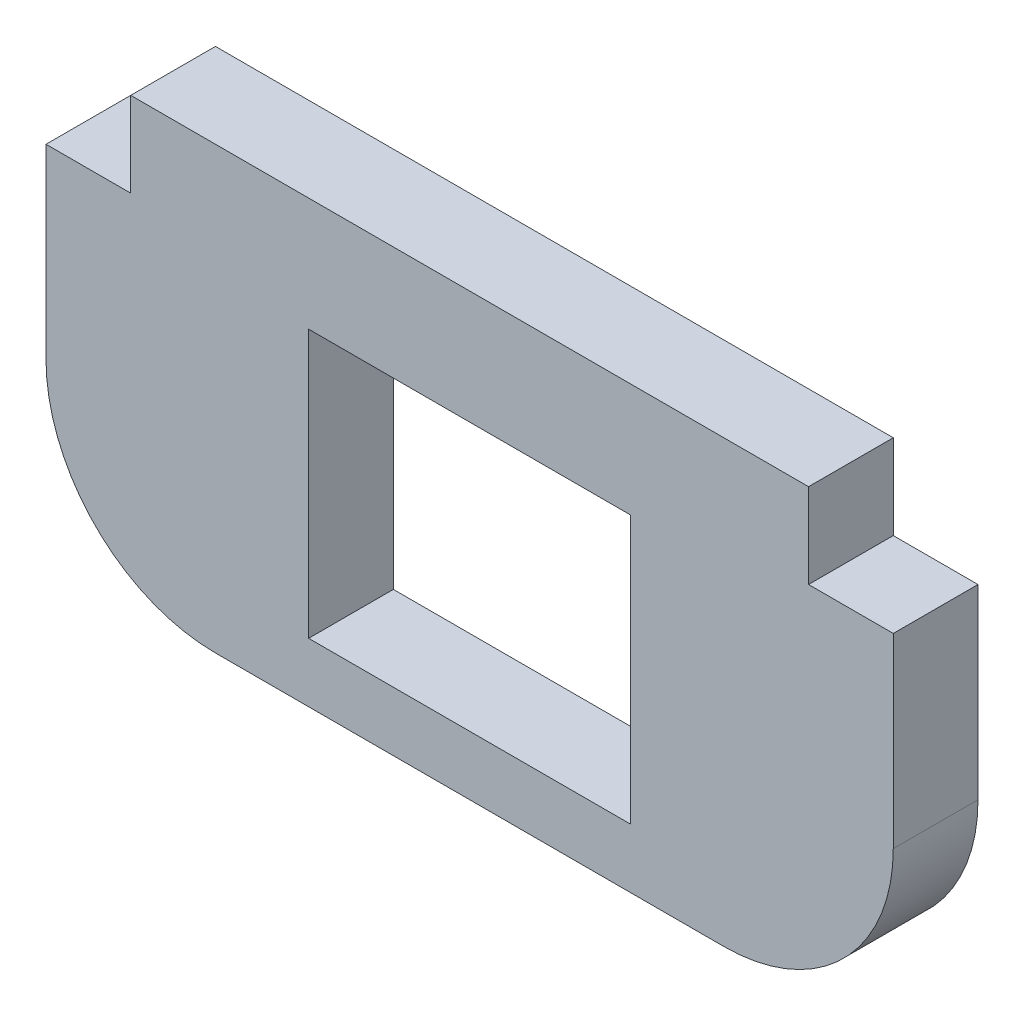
from build123d import *

# Parameters (mm, degrees)
SKETCH1_W           = 31.75
SKETCH1_H           = 16.51
BOSS_EXTRUDE1_DEPTH = 1.5875
SKETCH2_W           = 3.175
SKETCH2_H           = 3.175
CUT_EXTRUDE1_DEPTH  = 19.172541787
SKETCH3_W           = 12.065
SKETCH3_H           = 10.033
CUT_EXTRUDE2_DEPTH  = 19.172541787
FILLET1_R           = 6.35


with BuildPart() as part:
    # Sketch1 → Boss-Extrude1 (new, symmetric)
    with BuildSketch(Plane.XY):
        Rectangle(SKETCH1_W, SKETCH1_H)
    extrude(amount=BOSS_EXTRUDE1_DEPTH, both=True)

    # Sketch2 → Cut-Extrude1 (cut, through all)
    with BuildSketch(Plane.XY.offset(1.5875)):
        with Locations((-14.2875, 6.6675)):
            Rectangle(SKETCH2_W, SKETCH2_H)
        with Locations((14.2875, 6.6675)):
            Rectangle(SKETCH2_W, SKETCH2_H)
    extrude(amount=-CUT_EXTRUDE1_DEPTH, mode=Mode.SUBTRACT)

    # Sketch3 → Cut-Extrude2 (cut, through all)
    with BuildSketch(Plane.XY.offset(1.5875)):
        with Locations((0, -1.016)):
            Rectangle(SKETCH3_W, SKETCH3_H)
    extrude(amount=-CUT_EXTRUDE2_DEPTH, mode=Mode.SUBTRACT)

    # Fillet1
    fillet1_edges = [part.edges().sort_by_distance(p)[0] for p in [
        (15.875, -8.255, 0),
        (-15.875, -8.255, 0),
    ]]
    fillet(fillet1_edges, radius=FILLET1_R)


solid = part.part
